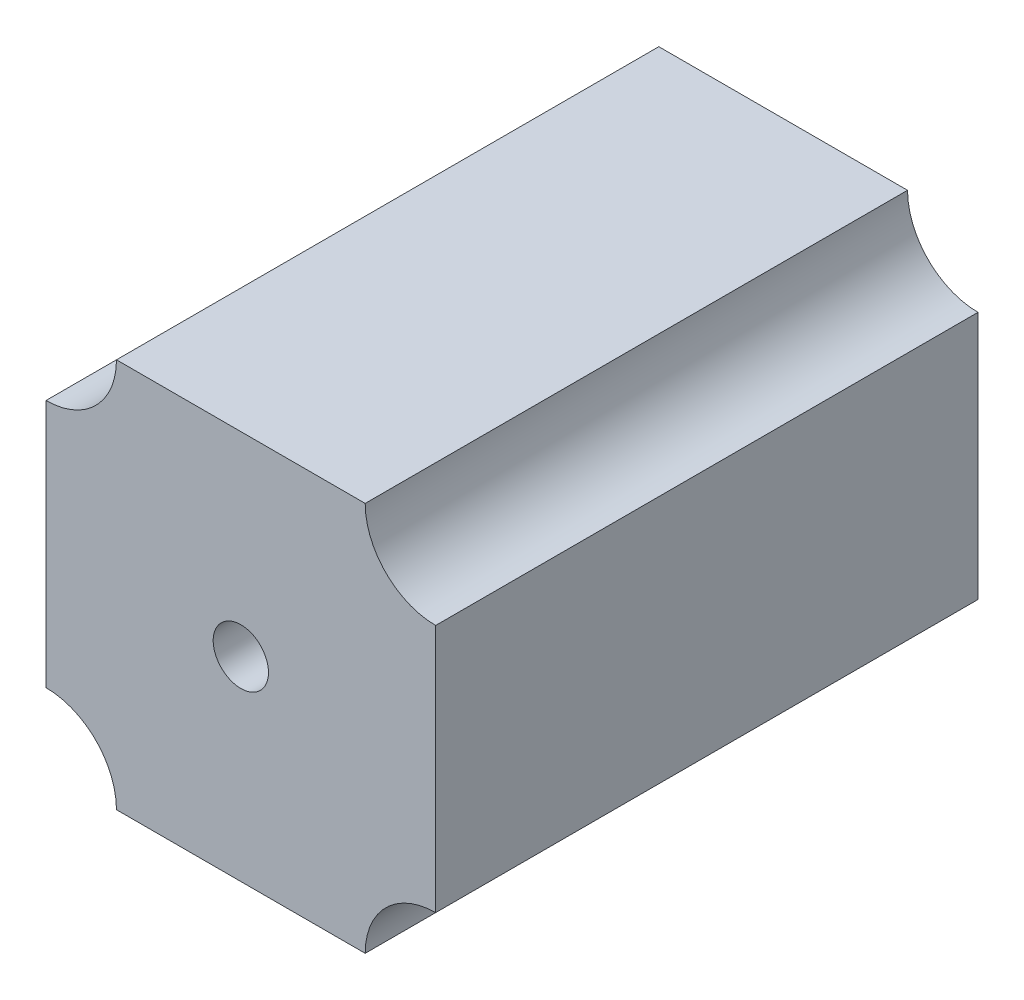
from build123d import *

# Parameters (mm, degrees)
EXTRUDE_1_DEPTH     = 78.5
SKETCH_2_R          = 4
CUT_EXTRUDE_1_DEPTH = 78.5


with BuildPart() as part:
    # Sketch 1 → Extrude 1 (new body)
    with BuildSketch(Plane.XY):
        with BuildLine():
            Line((18, -28.2), (-18, -28.2))
            ThreePointArc((-18, -28.2), (-20.987510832, -20.987510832), (-28.2, -18))
            Line((-28.2, -18), (-28.2, 18))
            ThreePointArc((-28.2, 18), (-20.987510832, 20.987510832), (-18, 28.2))
            Line((-18, 28.2), (18, 28.2))
            ThreePointArc((18, 28.2), (20.987510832, 20.987510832), (28.2, 18))
            Line((28.2, 18), (28.2, -18))
            ThreePointArc((28.2, -18), (20.987510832, -20.987510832), (18, -28.2))
        make_face()
    extrude(amount=EXTRUDE_1_DEPTH)

    # Sketch 2 → Cut-Extrude 1 (cut)
    with BuildSketch(Plane.XY.offset(78.5)):
        Circle(SKETCH_2_R)
    extrude(amount=-CUT_EXTRUDE_1_DEPTH, mode=Mode.SUBTRACT)


solid = part.part
